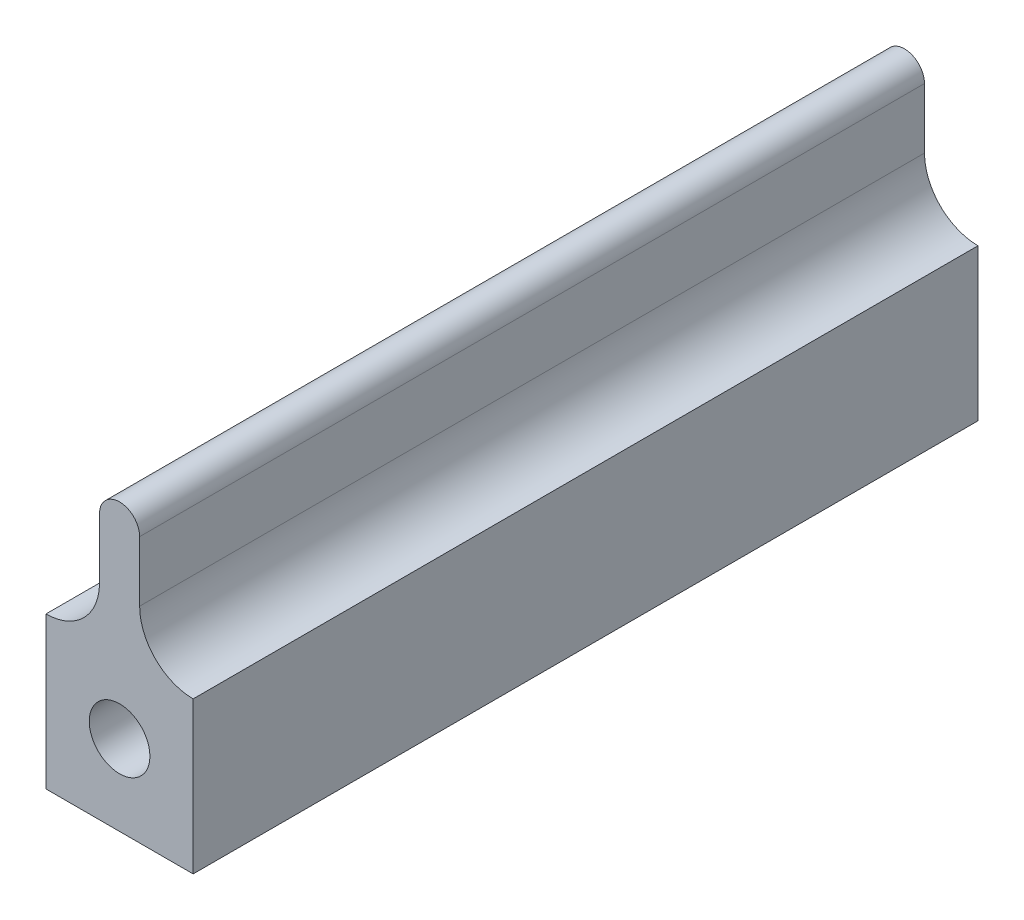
ISO-10303-21;
HEADER;
FILE_DESCRIPTION(('STEP AP214'),'2;1');
FILE_NAME('part.step','',(''),(''),'','','');
FILE_SCHEMA(('AUTOMOTIVE_DESIGN { 1 0 10303 214 1 1 1 1 }'));
ENDSEC;
DATA;
#1=APPLICATION_CONTEXT('core data for automotive mechanical design processes');
#2=APPLICATION_PROTOCOL_DEFINITION('international standard','automotive_design',2000,#1);
#3=PRODUCT_CONTEXT('',#1,'mechanical');
#4=PRODUCT('Part','Part','',(#3));
#5=PRODUCT_RELATED_PRODUCT_CATEGORY('part','',(#4));
#6=PRODUCT_DEFINITION_FORMATION('','',#4);
#7=PRODUCT_DEFINITION_CONTEXT('part definition',#1,'design');
#8=PRODUCT_DEFINITION('design','',#6,#7);
#9=PRODUCT_DEFINITION_SHAPE('','',#8);
#10=(LENGTH_UNIT() NAMED_UNIT(*) SI_UNIT(.MILLI.,.METRE.));
#11=(NAMED_UNIT(*) PLANE_ANGLE_UNIT() SI_UNIT($,.RADIAN.));
#12=(NAMED_UNIT(*) SI_UNIT($,.STERADIAN.) SOLID_ANGLE_UNIT());
#13=UNCERTAINTY_MEASURE_WITH_UNIT(LENGTH_MEASURE(1.E-05),#10,'distance_accuracy_value','');
#14=(GEOMETRIC_REPRESENTATION_CONTEXT(3) GLOBAL_UNCERTAINTY_ASSIGNED_CONTEXT((#13)) GLOBAL_UNIT_ASSIGNED_CONTEXT((#10,
#11,#12)) REPRESENTATION_CONTEXT('',''));
#15=CARTESIAN_POINT('',(0.,0.,0.));
#16=DIRECTION('',(0.,0.,1.));
#17=DIRECTION('',(1.,0.,0.));
#18=AXIS2_PLACEMENT_3D('',#15,#16,#17);
#19=CARTESIAN_POINT('',(-135.75,-154.500000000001,-88.));
#20=DIRECTION('',(-1.,0.,0.));
#21=DIRECTION('',(0.,0.,1.));
#22=AXIS2_PLACEMENT_3D('',#19,#20,#21);
#23=PLANE('',#22);
#24=DIRECTION('',(0.,-1.,0.));
#25=VECTOR('',#24,1.);
#26=CARTESIAN_POINT('',(-135.75,-154.500000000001,0.));
#27=LINE('',#26,#25);
#28=CARTESIAN_POINT('',(-135.75,-154.500000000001,0.));
#29=VERTEX_POINT('',#28);
#30=CARTESIAN_POINT('',(-135.75,-171.500000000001,0.));
#31=VERTEX_POINT('',#30);
#32=EDGE_CURVE('E111',#29,#31,#27,.T.);
#33=ORIENTED_EDGE('',*,*,#32,.F.);
#34=DIRECTION('',(0.,0.,1.));
#35=VECTOR('',#34,1.);
#36=CARTESIAN_POINT('',(-135.75,-154.500000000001,-88.));
#37=LINE('',#36,#35);
#38=CARTESIAN_POINT('',(-135.75,-154.500000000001,-88.));
#39=VERTEX_POINT('',#38);
#40=EDGE_CURVE('E11',#39,#29,#37,.T.);
#41=ORIENTED_EDGE('',*,*,#40,.F.);
#42=DIRECTION('',(0.,-1.,0.));
#43=VECTOR('',#42,1.);
#44=CARTESIAN_POINT('',(-135.75,-154.500000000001,-88.));
#45=LINE('',#44,#43);
#46=CARTESIAN_POINT('',(-135.75,-171.500000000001,-88.));
#47=VERTEX_POINT('',#46);
#48=EDGE_CURVE('E137',#39,#47,#45,.T.);
#49=ORIENTED_EDGE('',*,*,#48,.T.);
#50=DIRECTION('',(0.,0.,1.));
#51=VECTOR('',#50,1.);
#52=CARTESIAN_POINT('',(-135.75,-171.500000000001,-88.));
#53=LINE('',#52,#51);
#54=EDGE_CURVE('E36',#47,#31,#53,.T.);
#55=ORIENTED_EDGE('',*,*,#54,.T.);
#56=EDGE_LOOP('',(#33,#41,#49,#55));
#57=FACE_BOUND('',#56,.T.);
#58=ADVANCED_FACE('F33',(#57),#23,.T.);
#59=CARTESIAN_POINT('',(-135.75,-148.500000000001,-88.));
#60=DIRECTION('',(0.,0.,1.));
#61=DIRECTION('',(1.,0.,0.));
#62=AXIS2_PLACEMENT_3D('',#59,#60,#61);
#63=CYLINDRICAL_SURFACE('',#62,5.99999999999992);
#64=CARTESIAN_POINT('',(-135.75,-148.500000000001,0.));
#65=DIRECTION('',(0.,0.,-1.));
#66=DIRECTION('',(1.,0.,0.));
#67=AXIS2_PLACEMENT_3D('',#64,#65,#66);
#68=CIRCLE('',#67,5.99999999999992);
#69=CARTESIAN_POINT('',(-129.75,-148.500000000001,0.));
#70=VERTEX_POINT('',#69);
#71=EDGE_CURVE('E134',#70,#29,#68,.T.);
#72=ORIENTED_EDGE('',*,*,#71,.F.);
#73=DIRECTION('',(0.,0.,1.));
#74=VECTOR('',#73,1.);
#75=CARTESIAN_POINT('',(-129.75,-148.500000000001,-88.));
#76=LINE('',#75,#74);
#77=CARTESIAN_POINT('',(-129.75,-148.500000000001,-88.));
#78=VERTEX_POINT('',#77);
#79=EDGE_CURVE('E41',#78,#70,#76,.T.);
#80=ORIENTED_EDGE('',*,*,#79,.F.);
#81=CARTESIAN_POINT('',(-135.75,-148.500000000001,-88.));
#82=DIRECTION('',(0.,0.,-1.));
#83=DIRECTION('',(1.,0.,0.));
#84=AXIS2_PLACEMENT_3D('',#81,#82,#83);
#85=CIRCLE('',#84,5.99999999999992);
#86=EDGE_CURVE('E156',#78,#39,#85,.T.);
#87=ORIENTED_EDGE('',*,*,#86,.T.);
#88=ORIENTED_EDGE('',*,*,#40,.T.);
#89=EDGE_LOOP('',(#72,#80,#87,#88));
#90=FACE_BOUND('',#89,.T.);
#91=ADVANCED_FACE('F175',(#90),#63,.F.);
#92=CARTESIAN_POINT('',(-129.75,-141.750000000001,-88.));
#93=DIRECTION('',(-1.,0.,0.));
#94=DIRECTION('',(0.,0.,1.));
#95=AXIS2_PLACEMENT_3D('',#92,#93,#94);
#96=PLANE('',#95);
#97=DIRECTION('',(0.,-1.,0.));
#98=VECTOR('',#97,1.);
#99=CARTESIAN_POINT('',(-129.75,-141.750000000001,0.));
#100=LINE('',#99,#98);
#101=CARTESIAN_POINT('',(-129.75,-141.750000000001,0.));
#102=VERTEX_POINT('',#101);
#103=EDGE_CURVE('E131',#102,#70,#100,.T.);
#104=ORIENTED_EDGE('',*,*,#103,.F.);
#105=DIRECTION('',(0.,0.,1.));
#106=VECTOR('',#105,1.);
#107=CARTESIAN_POINT('',(-129.75,-141.750000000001,-88.));
#108=LINE('',#107,#106);
#109=CARTESIAN_POINT('',(-129.75,-141.750000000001,-88.));
#110=VERTEX_POINT('',#109);
#111=EDGE_CURVE('E159',#110,#102,#108,.T.);
#112=ORIENTED_EDGE('',*,*,#111,.F.);
#113=DIRECTION('',(0.,-1.,0.));
#114=VECTOR('',#113,1.);
#115=CARTESIAN_POINT('',(-129.75,-141.750000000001,-88.));
#116=LINE('',#115,#114);
#117=EDGE_CURVE('E154',#110,#78,#116,.T.);
#118=ORIENTED_EDGE('',*,*,#117,.T.);
#119=ORIENTED_EDGE('',*,*,#79,.T.);
#120=EDGE_LOOP('',(#104,#112,#118,#119));
#121=FACE_BOUND('',#120,.T.);
#122=ADVANCED_FACE('F196',(#121),#96,.T.);
#123=CARTESIAN_POINT('',(-127.5,-141.750000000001,-88.));
#124=DIRECTION('',(0.,0.,1.));
#125=DIRECTION('',(1.,0.,0.));
#126=AXIS2_PLACEMENT_3D('',#123,#124,#125);
#127=CYLINDRICAL_SURFACE('',#126,2.25000000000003);
#128=CARTESIAN_POINT('',(-127.5,-141.750000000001,0.));
#129=DIRECTION('',(0.,0.,1.));
#130=DIRECTION('',(1.,0.,0.));
#131=AXIS2_PLACEMENT_3D('',#128,#129,#130);
#132=CIRCLE('',#131,2.25000000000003);
#133=CARTESIAN_POINT('',(-125.25,-141.750000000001,0.));
#134=VERTEX_POINT('',#133);
#135=EDGE_CURVE('E128',#134,#102,#132,.T.);
#136=ORIENTED_EDGE('',*,*,#135,.F.);
#137=DIRECTION('',(0.,0.,1.));
#138=VECTOR('',#137,1.);
#139=CARTESIAN_POINT('',(-125.25,-141.750000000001,-88.));
#140=LINE('',#139,#138);
#141=CARTESIAN_POINT('',(-125.25,-141.750000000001,-88.));
#142=VERTEX_POINT('',#141);
#143=EDGE_CURVE('E161',#142,#134,#140,.T.);
#144=ORIENTED_EDGE('',*,*,#143,.F.);
#145=CARTESIAN_POINT('',(-127.5,-141.750000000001,-88.));
#146=DIRECTION('',(0.,0.,1.));
#147=DIRECTION('',(1.,0.,0.));
#148=AXIS2_PLACEMENT_3D('',#145,#146,#147);
#149=CIRCLE('',#148,2.25000000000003);
#150=EDGE_CURVE('E151',#142,#110,#149,.T.);
#151=ORIENTED_EDGE('',*,*,#150,.T.);
#152=ORIENTED_EDGE('',*,*,#111,.T.);
#153=EDGE_LOOP('',(#136,#144,#151,#152));
#154=FACE_BOUND('',#153,.T.);
#155=ADVANCED_FACE('F194',(#154),#127,.T.);
#156=CARTESIAN_POINT('',(-125.25,-148.500000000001,-88.));
#157=DIRECTION('',(1.,0.,0.));
#158=DIRECTION('',(0.,0.,-1.));
#159=AXIS2_PLACEMENT_3D('',#156,#157,#158);
#160=PLANE('',#159);
#161=DIRECTION('',(0.,1.,0.));
#162=VECTOR('',#161,1.);
#163=CARTESIAN_POINT('',(-125.25,-148.500000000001,0.));
#164=LINE('',#163,#162);
#165=CARTESIAN_POINT('',(-125.25,-148.500000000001,0.));
#166=VERTEX_POINT('',#165);
#167=EDGE_CURVE('E125',#166,#134,#164,.T.);
#168=ORIENTED_EDGE('',*,*,#167,.F.);
#169=DIRECTION('',(0.,0.,1.));
#170=VECTOR('',#169,1.);
#171=CARTESIAN_POINT('',(-125.25,-148.500000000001,-88.));
#172=LINE('',#171,#170);
#173=CARTESIAN_POINT('',(-125.25,-148.500000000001,-88.));
#174=VERTEX_POINT('',#173);
#175=EDGE_CURVE('E163',#174,#166,#172,.T.);
#176=ORIENTED_EDGE('',*,*,#175,.F.);
#177=DIRECTION('',(0.,1.,0.));
#178=VECTOR('',#177,1.);
#179=CARTESIAN_POINT('',(-125.25,-148.500000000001,-88.));
#180=LINE('',#179,#178);
#181=EDGE_CURVE('E148',#174,#142,#180,.T.);
#182=ORIENTED_EDGE('',*,*,#181,.T.);
#183=ORIENTED_EDGE('',*,*,#143,.T.);
#184=EDGE_LOOP('',(#168,#176,#182,#183));
#185=FACE_BOUND('',#184,.T.);
#186=ADVANCED_FACE('F191',(#185),#160,.T.);
#187=CARTESIAN_POINT('',(-119.25,-148.500000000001,-88.));
#188=DIRECTION('',(0.,0.,1.));
#189=DIRECTION('',(1.,0.,0.));
#190=AXIS2_PLACEMENT_3D('',#187,#188,#189);
#191=CYLINDRICAL_SURFACE('',#190,5.99999999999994);
#192=CARTESIAN_POINT('',(-119.25,-148.500000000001,0.));
#193=DIRECTION('',(0.,0.,-1.));
#194=DIRECTION('',(1.,0.,0.));
#195=AXIS2_PLACEMENT_3D('',#192,#193,#194);
#196=CIRCLE('',#195,5.99999999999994);
#197=CARTESIAN_POINT('',(-119.25,-154.500000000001,0.));
#198=VERTEX_POINT('',#197);
#199=EDGE_CURVE('E122',#198,#166,#196,.T.);
#200=ORIENTED_EDGE('',*,*,#199,.F.);
#201=DIRECTION('',(0.,0.,1.));
#202=VECTOR('',#201,1.);
#203=CARTESIAN_POINT('',(-119.25,-154.500000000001,-88.));
#204=LINE('',#203,#202);
#205=CARTESIAN_POINT('',(-119.25,-154.500000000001,-88.));
#206=VERTEX_POINT('',#205);
#207=EDGE_CURVE('E165',#206,#198,#204,.T.);
#208=ORIENTED_EDGE('',*,*,#207,.F.);
#209=CARTESIAN_POINT('',(-119.25,-148.500000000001,-88.));
#210=DIRECTION('',(0.,0.,-1.));
#211=DIRECTION('',(1.,0.,0.));
#212=AXIS2_PLACEMENT_3D('',#209,#210,#211);
#213=CIRCLE('',#212,5.99999999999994);
#214=EDGE_CURVE('E145',#206,#174,#213,.T.);
#215=ORIENTED_EDGE('',*,*,#214,.T.);
#216=ORIENTED_EDGE('',*,*,#175,.T.);
#217=EDGE_LOOP('',(#200,#208,#215,#216));
#218=FACE_BOUND('',#217,.T.);
#219=ADVANCED_FACE('F189',(#218),#191,.F.);
#220=CARTESIAN_POINT('',(-119.25,-171.500000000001,-88.));
#221=DIRECTION('',(1.,0.,0.));
#222=DIRECTION('',(0.,0.,-1.));
#223=AXIS2_PLACEMENT_3D('',#220,#221,#222);
#224=PLANE('',#223);
#225=DIRECTION('',(0.,1.,0.));
#226=VECTOR('',#225,1.);
#227=CARTESIAN_POINT('',(-119.25,-171.500000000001,0.));
#228=LINE('',#227,#226);
#229=CARTESIAN_POINT('',(-119.25,-171.500000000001,0.));
#230=VERTEX_POINT('',#229);
#231=EDGE_CURVE('E119',#230,#198,#228,.T.);
#232=ORIENTED_EDGE('',*,*,#231,.F.);
#233=DIRECTION('',(0.,0.,1.));
#234=VECTOR('',#233,1.);
#235=CARTESIAN_POINT('',(-119.25,-171.500000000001,-88.));
#236=LINE('',#235,#234);
#237=CARTESIAN_POINT('',(-119.25,-171.500000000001,-88.));
#238=VERTEX_POINT('',#237);
#239=EDGE_CURVE('E166',#238,#230,#236,.T.);
#240=ORIENTED_EDGE('',*,*,#239,.F.);
#241=DIRECTION('',(0.,1.,0.));
#242=VECTOR('',#241,1.);
#243=CARTESIAN_POINT('',(-119.25,-171.500000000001,-88.));
#244=LINE('',#243,#242);
#245=EDGE_CURVE('E142',#238,#206,#244,.T.);
#246=ORIENTED_EDGE('',*,*,#245,.T.);
#247=ORIENTED_EDGE('',*,*,#207,.T.);
#248=EDGE_LOOP('',(#232,#240,#246,#247));
#249=FACE_BOUND('',#248,.T.);
#250=ADVANCED_FACE('F185',(#249),#224,.T.);
#251=CARTESIAN_POINT('',(-135.75,-171.500000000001,-88.));
#252=DIRECTION('',(0.,-1.,0.));
#253=DIRECTION('',(0.,0.,-1.));
#254=AXIS2_PLACEMENT_3D('',#251,#252,#253);
#255=PLANE('',#254);
#256=DIRECTION('',(1.,0.,0.));
#257=VECTOR('',#256,1.);
#258=CARTESIAN_POINT('',(-135.75,-171.500000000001,0.));
#259=LINE('',#258,#257);
#260=EDGE_CURVE('E116',#31,#230,#259,.T.);
#261=ORIENTED_EDGE('',*,*,#260,.F.);
#262=ORIENTED_EDGE('',*,*,#54,.F.);
#263=DIRECTION('',(1.,0.,0.));
#264=VECTOR('',#263,1.);
#265=CARTESIAN_POINT('',(-135.75,-171.500000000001,-88.));
#266=LINE('',#265,#264);
#267=EDGE_CURVE('E139',#47,#238,#266,.T.);
#268=ORIENTED_EDGE('',*,*,#267,.T.);
#269=ORIENTED_EDGE('',*,*,#239,.T.);
#270=EDGE_LOOP('',(#261,#262,#268,#269));
#271=FACE_BOUND('',#270,.T.);
#272=ADVANCED_FACE('F171',(#271),#255,.T.);
#273=CARTESIAN_POINT('',(-119.25,-148.500000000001,-88.));
#274=DIRECTION('',(0.,0.,1.));
#275=DIRECTION('',(1.,0.,0.));
#276=AXIS2_PLACEMENT_3D('',#273,#274,#275);
#277=PLANE('',#276);
#278=ORIENTED_EDGE('',*,*,#48,.F.);
#279=ORIENTED_EDGE('',*,*,#86,.F.);
#280=ORIENTED_EDGE('',*,*,#117,.F.);
#281=ORIENTED_EDGE('',*,*,#150,.F.);
#282=ORIENTED_EDGE('',*,*,#181,.F.);
#283=ORIENTED_EDGE('',*,*,#214,.F.);
#284=ORIENTED_EDGE('',*,*,#245,.F.);
#285=ORIENTED_EDGE('',*,*,#267,.F.);
#286=EDGE_LOOP('',(#278,#279,#280,#281,#282,#283,#284,#285));
#287=FACE_BOUND('',#286,.T.);
#288=ADVANCED_FACE('F179',(#287),#277,.F.);
#289=CARTESIAN_POINT('',(-119.25,-148.500000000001,0.));
#290=DIRECTION('',(0.,0.,1.));
#291=DIRECTION('',(1.,0.,0.));
#292=AXIS2_PLACEMENT_3D('',#289,#290,#291);
#293=PLANE('',#292);
#294=CARTESIAN_POINT('',(-127.5,-162.500000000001,0.));
#295=DIRECTION('',(0.,0.,1.));
#296=DIRECTION('',(1.,0.,0.));
#297=AXIS2_PLACEMENT_3D('',#294,#295,#296);
#298=CIRCLE('',#297,3.4);
#299=CARTESIAN_POINT('',(-124.1,-162.500000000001,0.));
#300=VERTEX_POINT('',#299);
#301=EDGE_CURVE('E108',#300,#300,#298,.T.);
#302=ORIENTED_EDGE('',*,*,#301,.F.);
#303=EDGE_LOOP('',(#302));
#304=FACE_BOUND('',#303,.T.);
#305=ORIENTED_EDGE('',*,*,#32,.T.);
#306=ORIENTED_EDGE('',*,*,#260,.T.);
#307=ORIENTED_EDGE('',*,*,#231,.T.);
#308=ORIENTED_EDGE('',*,*,#199,.T.);
#309=ORIENTED_EDGE('',*,*,#167,.T.);
#310=ORIENTED_EDGE('',*,*,#135,.T.);
#311=ORIENTED_EDGE('',*,*,#103,.T.);
#312=ORIENTED_EDGE('',*,*,#71,.T.);
#313=EDGE_LOOP('',(#305,#306,#307,#308,#309,#310,#311,#312));
#314=FACE_BOUND('',#313,.T.);
#315=ADVANCED_FACE('F173',(#304,#314),#293,.T.);
#316=CARTESIAN_POINT('',(-127.5,-162.500000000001,0.));
#317=DIRECTION('',(0.,0.,1.));
#318=DIRECTION('',(1.,0.,0.));
#319=AXIS2_PLACEMENT_3D('',#316,#317,#318);
#320=CYLINDRICAL_SURFACE('',#319,3.4);
#321=CARTESIAN_POINT('',(-127.5,-162.500000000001,-30.));
#322=DIRECTION('',(0.,0.,1.));
#323=DIRECTION('',(1.,0.,0.));
#324=AXIS2_PLACEMENT_3D('',#321,#322,#323);
#325=CIRCLE('',#324,3.4);
#326=CARTESIAN_POINT('',(-124.1,-162.500000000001,-30.));
#327=VERTEX_POINT('',#326);
#328=EDGE_CURVE('E106',#327,#327,#325,.T.);
#329=ORIENTED_EDGE('',*,*,#328,.F.);
#330=EDGE_LOOP('',(#329));
#331=FACE_BOUND('',#330,.T.);
#332=ORIENTED_EDGE('',*,*,#301,.T.);
#333=EDGE_LOOP('',(#332));
#334=FACE_BOUND('',#333,.T.);
#335=ADVANCED_FACE('F102',(#331,#334),#320,.F.);
#336=CARTESIAN_POINT('',(-127.5,-162.500000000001,-30.));
#337=DIRECTION('',(0.,0.,1.));
#338=DIRECTION('',(1.,0.,0.));
#339=AXIS2_PLACEMENT_3D('',#336,#337,#338);
#340=CONICAL_SURFACE('',#339,3.4,1.02974425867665);
#341=CARTESIAN_POINT('',(-127.5,-162.500000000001,-32.0429261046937));
#342=VERTEX_POINT('',#341);
#343=VERTEX_LOOP('',#342);
#344=FACE_BOUND('',#343,.T.);
#345=ORIENTED_EDGE('',*,*,#328,.T.);
#346=EDGE_LOOP('',(#345));
#347=FACE_BOUND('',#346,.T.);
#348=ADVANCED_FACE('F99',(#344,#347),#340,.F.);
#349=CLOSED_SHELL('',(#58,#91,#122,#155,#186,#219,#250,#272,#288,#315,#335,#348));
#350=MANIFOLD_SOLID_BREP('B2',#349);
#351=ADVANCED_BREP_SHAPE_REPRESENTATION('',(#18,#350),#14);
#352=SHAPE_DEFINITION_REPRESENTATION(#9,#351);
ENDSEC;
END-ISO-10303-21;
